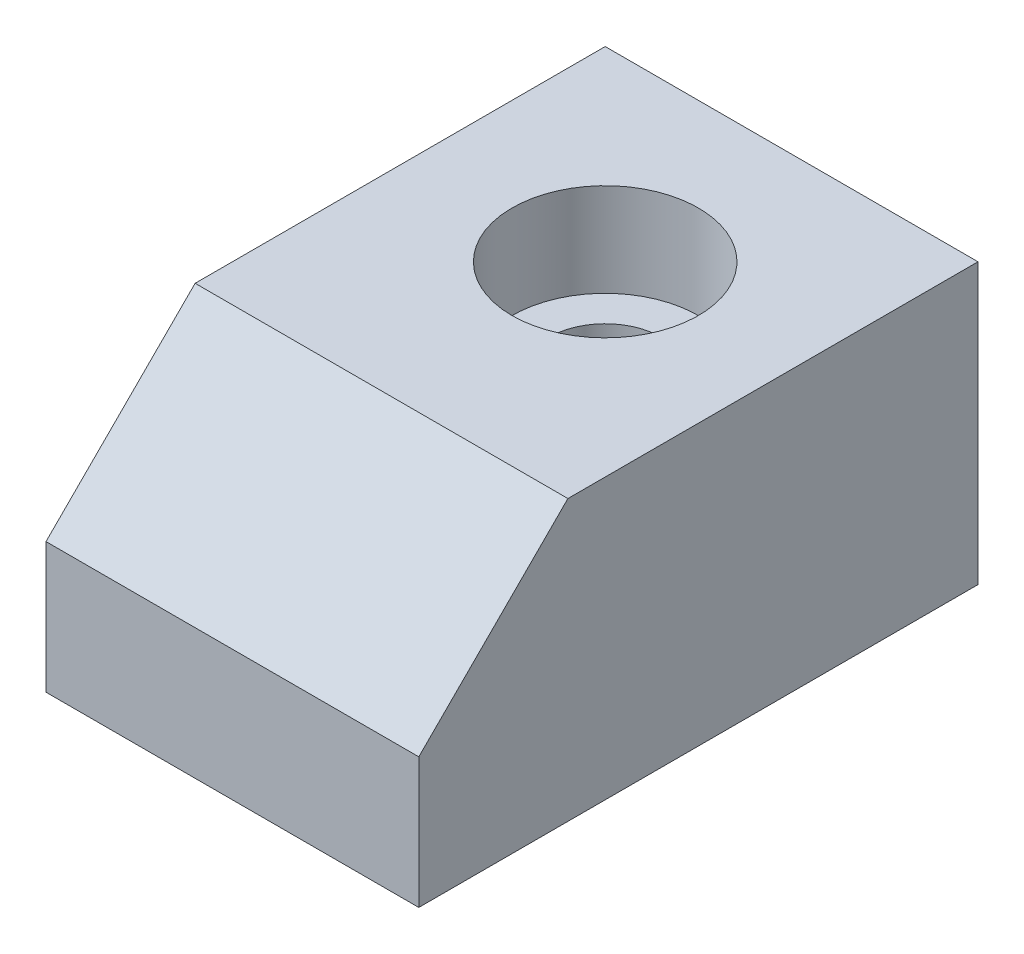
from build123d import *

# Parameters (mm, degrees)
SKETCH_1_W          = 30
SKETCH_1_H          = 15
EXTRUDE_1_DEPTH     = 20
CUT_EXTRUDE_1_DEPTH = 20


with BuildPart() as part:
    # Sketch 1 → Extrude 1 (new body)
    with BuildSketch(Plane(origin=(0, 0, 0), x_dir=(0, 0, -1), z_dir=(1, 0, 0))):
        Rectangle(SKETCH_1_W, SKETCH_1_H)
    extrude(amount=EXTRUDE_1_DEPTH)

    # Sketch 3 → Cut-Revolve 1 (revolve, cut)
    with BuildSketch(Plane(origin=(10, 0, 0), x_dir=(0, 0, -1), z_dir=(1, 0, 0))):
        Polygon((5, 7.523226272), (0, 7.5), (0, 2.5), (2, 2.5), (2, -7.5), (5, -7.5), align=None)
    revolve(axis=Axis((10, 10.15105742, -5), (0, -1, 0)), mode=Mode.SUBTRACT)

    # Sketch 4 → Cut-Extrude 1 (cut)
    with BuildSketch(Plane(origin=(20, 0, 0), x_dir=(0, 0, -1), z_dir=(1, 0, 0))):
        Polygon((-15, 7.5), (-15, -0.5), (-7, 7.5), align=None)
    extrude(amount=-CUT_EXTRUDE_1_DEPTH, mode=Mode.SUBTRACT)


solid = part.part
